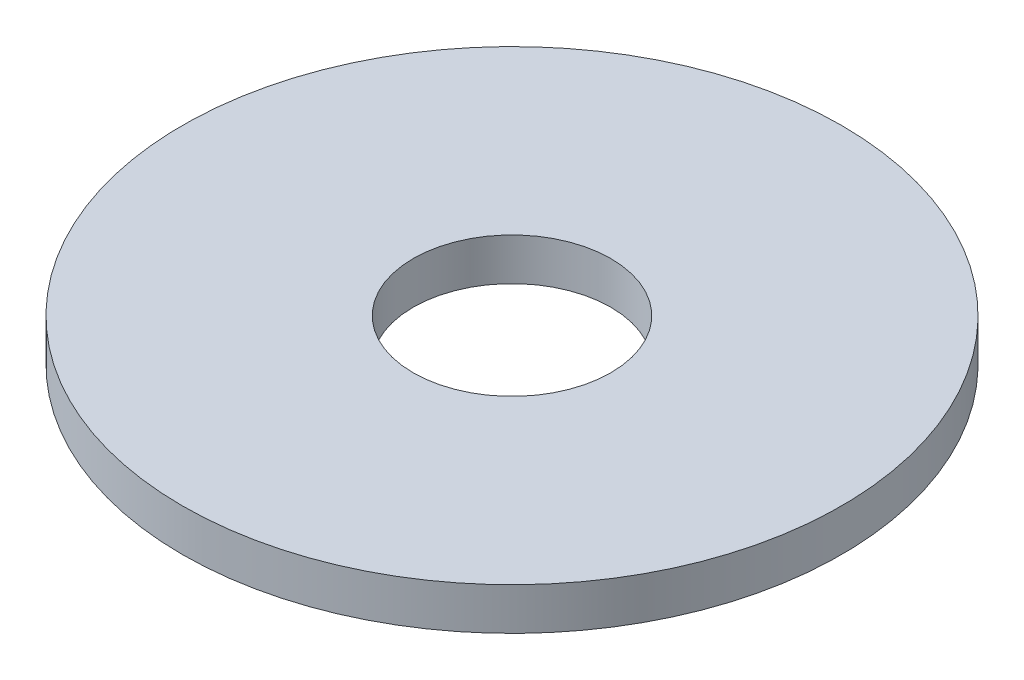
from build123d import *

# Parameters (mm, degrees)
SKETCH1_R           = 15.875
SKETCH1_R_2         = 4.7625
BOSS_EXTRUDE1_DEPTH = 2.032


with BuildPart() as part:
    # Sketch1 → Boss-Extrude1 (new body)
    with BuildSketch(Plane(origin=(0, 0, 0), x_dir=(1, 0, 0), z_dir=(0, 1, 0))):
        with Locations(Location((0, 0, 0), (0, 0, 270))):
            Circle(SKETCH1_R)
        with Locations(Location((0, 0, 0), (0, 0, 270))):
            Circle(SKETCH1_R_2, mode=Mode.SUBTRACT)
    extrude(amount=BOSS_EXTRUDE1_DEPTH)


solid = part.part
